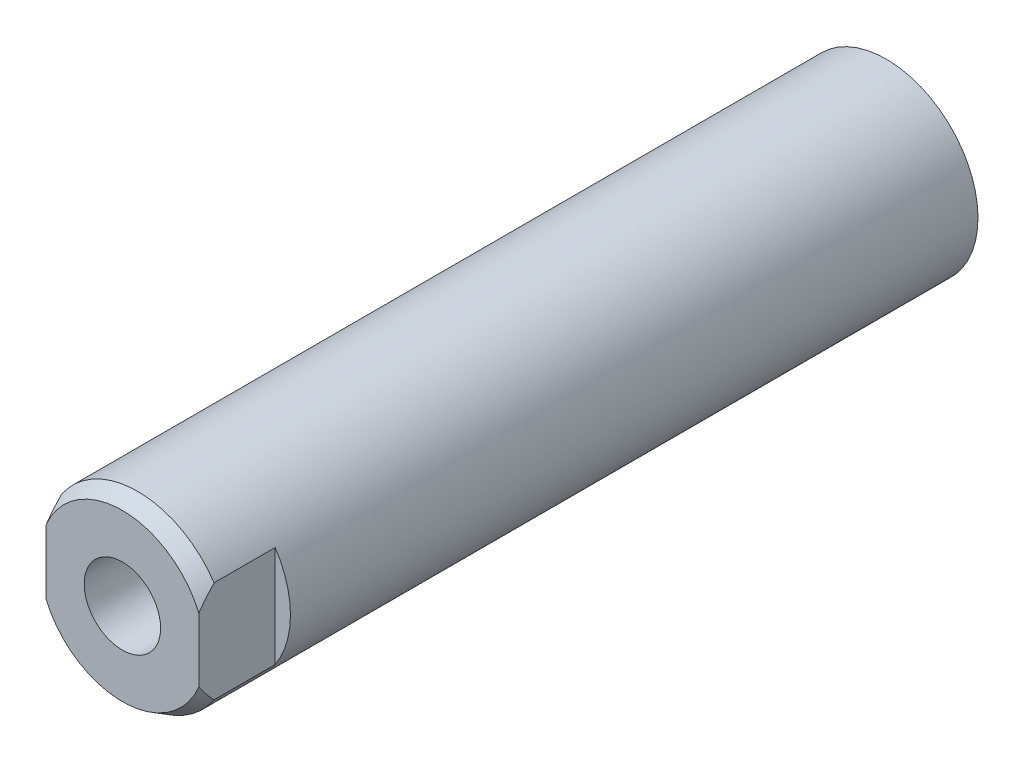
ISO-10303-21;
HEADER;
FILE_DESCRIPTION(('STEP AP214'),'2;1');
FILE_NAME('part.step','',(''),(''),'','','');
FILE_SCHEMA(('AUTOMOTIVE_DESIGN { 1 0 10303 214 1 1 1 1 }'));
ENDSEC;
DATA;
#1=APPLICATION_CONTEXT('core data for automotive mechanical design processes');
#2=APPLICATION_PROTOCOL_DEFINITION('international standard','automotive_design',2000,#1);
#3=PRODUCT_CONTEXT('',#1,'mechanical');
#4=PRODUCT('Part','Part','',(#3));
#5=PRODUCT_RELATED_PRODUCT_CATEGORY('part','',(#4));
#6=PRODUCT_DEFINITION_FORMATION('','',#4);
#7=PRODUCT_DEFINITION_CONTEXT('part definition',#1,'design');
#8=PRODUCT_DEFINITION('design','',#6,#7);
#9=PRODUCT_DEFINITION_SHAPE('','',#8);
#10=(LENGTH_UNIT() NAMED_UNIT(*) SI_UNIT(.MILLI.,.METRE.));
#11=(NAMED_UNIT(*) PLANE_ANGLE_UNIT() SI_UNIT($,.RADIAN.));
#12=(NAMED_UNIT(*) SI_UNIT($,.STERADIAN.) SOLID_ANGLE_UNIT());
#13=UNCERTAINTY_MEASURE_WITH_UNIT(LENGTH_MEASURE(1.E-05),#10,'distance_accuracy_value','');
#14=(GEOMETRIC_REPRESENTATION_CONTEXT(3) GLOBAL_UNCERTAINTY_ASSIGNED_CONTEXT((#13)) GLOBAL_UNIT_ASSIGNED_CONTEXT((#10,
#11,#12)) REPRESENTATION_CONTEXT('',''));
#15=CARTESIAN_POINT('',(0.,0.,0.));
#16=DIRECTION('',(0.,0.,1.));
#17=DIRECTION('',(1.,0.,0.));
#18=AXIS2_PLACEMENT_3D('',#15,#16,#17);
#19=CARTESIAN_POINT('',(0.,0.,-1.));
#20=DIRECTION('',(0.,0.,-1.));
#21=DIRECTION('',(-1.,0.,0.));
#22=AXIS2_PLACEMENT_3D('',#19,#20,#21);
#23=CONICAL_SURFACE('',#22,6.,0.523598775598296);
#24=CARTESIAN_POINT('',(-5.,-8.85766999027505,-8.22515674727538));
#25=CARTESIAN_POINT('',(-5.,-8.7036084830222,-7.99280002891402));
#26=CARTESIAN_POINT('',(-5.,-8.54888837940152,-7.76087738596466));
#27=CARTESIAN_POINT('',(-5.,-8.23787904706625,-7.29807481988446));
#28=CARTESIAN_POINT('',(-5.,-8.08158976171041,-7.06719493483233));
#29=CARTESIAN_POINT('',(-5.,-7.76700623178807,-6.60638363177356));
#30=CARTESIAN_POINT('',(-5.,-7.6087097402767,-6.37645374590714));
#31=CARTESIAN_POINT('',(-5.,-7.2899833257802,-5.91808013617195));
#32=CARTESIAN_POINT('',(-5.,-7.12955342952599,-5.68963639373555));
#33=CARTESIAN_POINT('',(-5.,-6.80168797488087,-5.22825279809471));
#34=CARTESIAN_POINT('',(-5.,-6.63418137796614,-4.99536334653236));
#35=CARTESIAN_POINT('',(-5.,-6.29594329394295,-4.53193915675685));
#36=CARTESIAN_POINT('',(-5.,-6.12521185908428,-4.30140438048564));
#37=CARTESIAN_POINT('',(-5.,-5.77989669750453,-3.84342760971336));
#38=CARTESIAN_POINT('',(-5.,-5.60531511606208,-3.61598400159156));
#39=CARTESIAN_POINT('',(-5.,-5.25127064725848,-3.16493707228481));
#40=CARTESIAN_POINT('',(-5.,-5.07180808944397,-2.94133349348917));
#41=CARTESIAN_POINT('',(-5.,-4.70778635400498,-2.50051757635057));
#42=CARTESIAN_POINT('',(-5.,-4.52326361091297,-2.28327525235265));
#43=CARTESIAN_POINT('',(-5.,-4.1462741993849,-1.85552355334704));
#44=CARTESIAN_POINT('',(-5.,-3.95380358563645,-1.64501761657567));
#45=CARTESIAN_POINT('',(-5.,-3.65800431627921,-1.3373107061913));
#46=CARTESIAN_POINT('',(-5.,-3.55854600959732,-1.23638850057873));
#47=CARTESIAN_POINT('',(-5.,-3.35669407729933,-1.03753063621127));
#48=CARTESIAN_POINT('',(-5.,-3.25430073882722,-0.93959468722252));
#49=CARTESIAN_POINT('',(-5.,-3.04620464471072,-0.74746151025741));
#50=CARTESIAN_POINT('',(-5.,-2.94050460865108,-0.653261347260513));
#51=CARTESIAN_POINT('',(-5.,-2.72521179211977,-0.469439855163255));
#52=CARTESIAN_POINT('',(-5.,-2.61561995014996,-0.37981743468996));
#53=CARTESIAN_POINT('',(-5.,-2.41737252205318,-0.226072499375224));
#54=CARTESIAN_POINT('',(-5.,-2.32962216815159,-0.160785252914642));
#55=CARTESIAN_POINT('',(-5.,-2.15114942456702,-0.034382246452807));
#56=CARTESIAN_POINT('',(-5.,-2.06042702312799,0.0267334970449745));
#57=CARTESIAN_POINT('',(-5.,-1.87562867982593,0.143967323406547));
#58=CARTESIAN_POINT('',(-5.,-1.78154868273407,0.200079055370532));
#59=CARTESIAN_POINT('',(-5.,-1.5899296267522,0.306111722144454));
#60=CARTESIAN_POINT('',(-5.,-1.4923904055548,0.356032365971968));
#61=CARTESIAN_POINT('',(-5.,-1.291974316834,0.449198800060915));
#62=CARTESIAN_POINT('',(-5.,-1.18903262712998,0.492306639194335));
#63=CARTESIAN_POINT('',(-5.,-0.979716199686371,0.569142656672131));
#64=CARTESIAN_POINT('',(-5.,-0.8733430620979,0.602875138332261));
#65=CARTESIAN_POINT('',(-5.,-0.658050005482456,0.65930625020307));
#66=CARTESIAN_POINT('',(-5.,-0.549139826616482,0.682041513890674));
#67=CARTESIAN_POINT('',(-5.,-0.32947006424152,0.715335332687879));
#68=CARTESIAN_POINT('',(-5.,-0.218711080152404,0.725897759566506));
#69=CARTESIAN_POINT('',(-5.,-0.0127563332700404,0.733586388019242));
#70=CARTESIAN_POINT('',(-5.,0.082378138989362,0.732431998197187));
#71=CARTESIAN_POINT('',(-5.,0.272064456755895,0.720793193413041));
#72=CARTESIAN_POINT('',(-5.,0.366616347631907,0.71030951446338));
#73=CARTESIAN_POINT('',(-5.,0.554426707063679,0.680480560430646));
#74=CARTESIAN_POINT('',(-5.,0.647683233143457,0.66112320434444));
#75=CARTESIAN_POINT('',(-5.,0.832164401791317,0.614350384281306));
#76=CARTESIAN_POINT('',(-5.,0.923388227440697,0.586931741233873));
#77=CARTESIAN_POINT('',(-5.,1.13328595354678,0.514715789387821));
#78=CARTESIAN_POINT('',(-5.,1.2510129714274,0.467171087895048));
#79=CARTESIAN_POINT('',(-5.,1.48176506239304,0.361820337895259));
#80=CARTESIAN_POINT('',(-5.,1.59478785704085,0.30400938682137));
#81=CARTESIAN_POINT('',(-5.,1.81655119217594,0.180007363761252));
#82=CARTESIAN_POINT('',(-5.,1.92527749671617,0.113791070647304));
#83=CARTESIAN_POINT('',(-5.,2.13839178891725,-0.0251762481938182));
#84=CARTESIAN_POINT('',(-5.,2.24278078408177,-0.0979257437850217));
#85=CARTESIAN_POINT('',(-5.,2.5038437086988,-0.289931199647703));
#86=CARTESIAN_POINT('',(-5.,2.65783080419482,-0.412830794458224));
#87=CARTESIAN_POINT('',(-5.,2.95823303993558,-0.667617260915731));
#88=CARTESIAN_POINT('',(-5.,3.10464323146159,-0.799509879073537));
#89=CARTESIAN_POINT('',(-5.,3.39152678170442,-1.07019413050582));
#90=CARTESIAN_POINT('',(-5.,3.53198602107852,-1.20900063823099));
#91=CARTESIAN_POINT('',(-5.,3.80771324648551,-1.49158354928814));
#92=CARTESIAN_POINT('',(-5.,3.9429824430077,-1.63535877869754));
#93=CARTESIAN_POINT('',(-5.,4.2103510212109,-1.92797411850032));
#94=CARTESIAN_POINT('',(-5.,4.34241548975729,-2.07684600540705));
#95=CARTESIAN_POINT('',(-5.,4.60294887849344,-2.37770588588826));
#96=CARTESIAN_POINT('',(-5.,4.73141762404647,-2.52969403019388));
#97=CARTESIAN_POINT('',(-5.,4.98516061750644,-2.83596911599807));
#98=CARTESIAN_POINT('',(-5.,5.11043886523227,-2.99025275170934));
#99=CARTESIAN_POINT('',(-5.,5.3584367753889,-3.30086429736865));
#100=CARTESIAN_POINT('',(-5.,5.48115638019,-3.45719225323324));
#101=CARTESIAN_POINT('',(-5.,5.74851674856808,-3.8026963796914));
#102=CARTESIAN_POINT('',(-5.,5.8926806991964,-3.99224116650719));
#103=CARTESIAN_POINT('',(-5.,6.17837278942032,-4.37330562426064));
#104=CARTESIAN_POINT('',(-5.,6.31990089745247,-4.56482531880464));
#105=CARTESIAN_POINT('',(-5.,6.74128772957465,-5.14199066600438));
#106=CARTESIAN_POINT('',(-5.,7.01781542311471,-5.53006826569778));
#107=CARTESIAN_POINT('',(-5.,7.55754763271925,-6.30106249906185));
#108=CARTESIAN_POINT('',(-5.,7.82091246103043,-6.68386751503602));
#109=CARTESIAN_POINT('',(-5.,8.21229240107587,-7.2603583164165));
#110=CARTESIAN_POINT('',(-5.,8.3420955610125,-7.45283346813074));
#111=CARTESIAN_POINT('',(-5.,8.60064308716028,-7.83848938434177));
#112=CARTESIAN_POINT('',(-5.,8.72938746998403,-8.03167013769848));
#113=CARTESIAN_POINT('',(-5.,8.85766999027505,-8.22515674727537));
#114=B_SPLINE_CURVE_WITH_KNOTS('',3,(#24,#25,#26,#27,#28,#29,#30,#31,#32,#33,#34,#35,#36,#37,
#38,#39,#40,#41,#42,#43,#44,#45,#46,#47,#48,#49,#50,#51,#52,#53,#54,#55,#56,#57,#58,#59,#60,#61,
#62,#63,#64,#65,#66,#67,#68,#69,#70,#71,#72,#73,#74,#75,#76,#77,#78,#79,#80,#81,#82,#83,#84,#85,
#86,#87,#88,#89,#90,#91,#92,#93,#94,#95,#96,#97,#98,#99,#100,#101,#102,#103,#104,#105,#106,#107,
#108,#109,#110,#111,#112,#113),.UNSPECIFIED.,.F.,.F.,(4,2,2,2,2,2,2,2,2,2,2,2,2,2,2,2,2,2,2,2,2,
2,2,2,2,2,2,2,2,2,2,2,2,2,2,2,2,2,2,2,2,2,2,2,4),(0.,0.836376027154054,1.67278235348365,
2.51022639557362,3.34765995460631,4.20825562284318,5.06883735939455,5.9289511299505,
6.78900697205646,7.64397449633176,8.49937165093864,8.92440617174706,9.3493992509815,
9.77405153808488,10.1986021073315,10.5266236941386,10.8546465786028,11.1830800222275,
11.5115288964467,11.8459529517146,12.1802232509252,12.5133722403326,12.8464152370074,
13.1313841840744,13.4163306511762,13.7016662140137,13.9871144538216,14.3673767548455,
14.7478211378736,15.1294353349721,15.5109603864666,16.1015030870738,16.6924267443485,
17.2846817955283,17.8767978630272,18.4737500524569,19.0707311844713,19.6669228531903,
20.2631279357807,20.9775178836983,21.6919163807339,23.1213719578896,24.5152832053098,
25.2117426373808,25.9081911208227),.UNSPECIFIED.);
#115=CARTESIAN_POINT('',(-5.,-3.3166247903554,-1.));
#116=VERTEX_POINT('',#115);
#117=CARTESIAN_POINT('',(-5.,-2.09884018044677,0.));
#118=VERTEX_POINT('',#117);
#119=EDGE_CURVE('E44',#116,#118,#114,.T.);
#120=ORIENTED_EDGE('',*,*,#119,.F.);
#121=CARTESIAN_POINT('',(0.,0.,-1.));
#122=DIRECTION('',(0.,0.,1.));
#123=DIRECTION('',(1.,0.,0.));
#124=AXIS2_PLACEMENT_3D('',#121,#122,#123);
#125=CIRCLE('',#124,6.);
#126=CARTESIAN_POINT('',(5.,-3.3166247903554,-1.));
#127=VERTEX_POINT('',#126);
#128=EDGE_CURVE('E126',#127,#116,#125,.F.);
#129=ORIENTED_EDGE('',*,*,#128,.F.);
#130=CARTESIAN_POINT('',(5.,8.85766999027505,-8.22515674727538));
#131=CARTESIAN_POINT('',(5.,8.7036084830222,-7.99280002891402));
#132=CARTESIAN_POINT('',(5.,8.54888837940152,-7.76087738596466));
#133=CARTESIAN_POINT('',(5.,8.23787904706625,-7.29807481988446));
#134=CARTESIAN_POINT('',(5.,8.08158976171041,-7.06719493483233));
#135=CARTESIAN_POINT('',(5.,7.76700623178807,-6.60638363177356));
#136=CARTESIAN_POINT('',(5.,7.6087097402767,-6.37645374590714));
#137=CARTESIAN_POINT('',(5.,7.2899833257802,-5.91808013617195));
#138=CARTESIAN_POINT('',(5.,7.12955342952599,-5.68963639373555));
#139=CARTESIAN_POINT('',(5.,6.80168797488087,-5.22825279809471));
#140=CARTESIAN_POINT('',(5.,6.63418137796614,-4.99536334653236));
#141=CARTESIAN_POINT('',(5.,6.29594329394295,-4.53193915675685));
#142=CARTESIAN_POINT('',(5.,6.12521185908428,-4.30140438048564));
#143=CARTESIAN_POINT('',(5.,5.77989669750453,-3.84342760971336));
#144=CARTESIAN_POINT('',(5.,5.60531511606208,-3.61598400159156));
#145=CARTESIAN_POINT('',(5.,5.25127064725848,-3.16493707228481));
#146=CARTESIAN_POINT('',(5.,5.07180808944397,-2.94133349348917));
#147=CARTESIAN_POINT('',(5.,4.70778635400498,-2.50051757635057));
#148=CARTESIAN_POINT('',(5.,4.52326361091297,-2.28327525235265));
#149=CARTESIAN_POINT('',(5.,4.1462741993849,-1.85552355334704));
#150=CARTESIAN_POINT('',(5.,3.95380358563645,-1.64501761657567));
#151=CARTESIAN_POINT('',(5.,3.65800431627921,-1.3373107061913));
#152=CARTESIAN_POINT('',(5.,3.55854600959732,-1.23638850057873));
#153=CARTESIAN_POINT('',(5.,3.35669407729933,-1.03753063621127));
#154=CARTESIAN_POINT('',(5.,3.25430073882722,-0.93959468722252));
#155=CARTESIAN_POINT('',(5.,3.04620464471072,-0.74746151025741));
#156=CARTESIAN_POINT('',(5.,2.94050460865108,-0.653261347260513));
#157=CARTESIAN_POINT('',(5.,2.72521179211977,-0.469439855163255));
#158=CARTESIAN_POINT('',(5.,2.61561995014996,-0.37981743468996));
#159=CARTESIAN_POINT('',(5.,2.41737252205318,-0.226072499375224));
#160=CARTESIAN_POINT('',(5.,2.32962216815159,-0.160785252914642));
#161=CARTESIAN_POINT('',(5.,2.15114942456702,-0.034382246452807));
#162=CARTESIAN_POINT('',(5.,2.06042702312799,0.0267334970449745));
#163=CARTESIAN_POINT('',(5.,1.87562867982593,0.143967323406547));
#164=CARTESIAN_POINT('',(5.,1.78154868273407,0.200079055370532));
#165=CARTESIAN_POINT('',(5.,1.5899296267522,0.306111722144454));
#166=CARTESIAN_POINT('',(5.,1.4923904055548,0.356032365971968));
#167=CARTESIAN_POINT('',(5.,1.291974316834,0.449198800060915));
#168=CARTESIAN_POINT('',(5.,1.18903262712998,0.492306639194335));
#169=CARTESIAN_POINT('',(5.,0.979716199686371,0.569142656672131));
#170=CARTESIAN_POINT('',(5.,0.8733430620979,0.602875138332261));
#171=CARTESIAN_POINT('',(5.,0.658050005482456,0.65930625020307));
#172=CARTESIAN_POINT('',(5.,0.549139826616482,0.682041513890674));
#173=CARTESIAN_POINT('',(5.,0.32947006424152,0.715335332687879));
#174=CARTESIAN_POINT('',(5.,0.218711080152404,0.725897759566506));
#175=CARTESIAN_POINT('',(5.,0.0127563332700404,0.733586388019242));
#176=CARTESIAN_POINT('',(5.,-0.082378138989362,0.732431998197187));
#177=CARTESIAN_POINT('',(5.,-0.272064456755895,0.720793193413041));
#178=CARTESIAN_POINT('',(5.,-0.366616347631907,0.71030951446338));
#179=CARTESIAN_POINT('',(5.,-0.554426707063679,0.680480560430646));
#180=CARTESIAN_POINT('',(5.,-0.647683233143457,0.66112320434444));
#181=CARTESIAN_POINT('',(5.,-0.832164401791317,0.614350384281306));
#182=CARTESIAN_POINT('',(5.,-0.923388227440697,0.586931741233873));
#183=CARTESIAN_POINT('',(5.,-1.13328595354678,0.514715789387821));
#184=CARTESIAN_POINT('',(5.,-1.2510129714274,0.467171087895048));
#185=CARTESIAN_POINT('',(5.,-1.48176506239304,0.361820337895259));
#186=CARTESIAN_POINT('',(5.,-1.59478785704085,0.30400938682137));
#187=CARTESIAN_POINT('',(5.,-1.81655119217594,0.180007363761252));
#188=CARTESIAN_POINT('',(5.,-1.92527749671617,0.113791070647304));
#189=CARTESIAN_POINT('',(5.,-2.13839178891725,-0.0251762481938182));
#190=CARTESIAN_POINT('',(5.,-2.24278078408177,-0.0979257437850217));
#191=CARTESIAN_POINT('',(5.,-2.5038437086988,-0.289931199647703));
#192=CARTESIAN_POINT('',(5.,-2.65783080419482,-0.412830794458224));
#193=CARTESIAN_POINT('',(5.,-2.95823303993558,-0.667617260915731));
#194=CARTESIAN_POINT('',(5.,-3.10464323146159,-0.799509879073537));
#195=CARTESIAN_POINT('',(5.,-3.39152678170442,-1.07019413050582));
#196=CARTESIAN_POINT('',(5.,-3.53198602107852,-1.20900063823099));
#197=CARTESIAN_POINT('',(5.,-3.80771324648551,-1.49158354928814));
#198=CARTESIAN_POINT('',(5.,-3.9429824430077,-1.63535877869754));
#199=CARTESIAN_POINT('',(5.,-4.2103510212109,-1.92797411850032));
#200=CARTESIAN_POINT('',(5.,-4.34241548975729,-2.07684600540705));
#201=CARTESIAN_POINT('',(5.,-4.60294887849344,-2.37770588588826));
#202=CARTESIAN_POINT('',(5.,-4.73141762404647,-2.52969403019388));
#203=CARTESIAN_POINT('',(5.,-4.98516061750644,-2.83596911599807));
#204=CARTESIAN_POINT('',(5.,-5.11043886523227,-2.99025275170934));
#205=CARTESIAN_POINT('',(5.,-5.3584367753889,-3.30086429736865));
#206=CARTESIAN_POINT('',(5.,-5.48115638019,-3.45719225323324));
#207=CARTESIAN_POINT('',(5.,-5.74851674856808,-3.8026963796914));
#208=CARTESIAN_POINT('',(5.,-5.8926806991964,-3.99224116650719));
#209=CARTESIAN_POINT('',(5.,-6.17837278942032,-4.37330562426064));
#210=CARTESIAN_POINT('',(5.,-6.31990089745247,-4.56482531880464));
#211=CARTESIAN_POINT('',(5.,-6.74128772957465,-5.14199066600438));
#212=CARTESIAN_POINT('',(5.,-7.01781542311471,-5.53006826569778));
#213=CARTESIAN_POINT('',(5.,-7.55754763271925,-6.30106249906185));
#214=CARTESIAN_POINT('',(5.,-7.82091246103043,-6.68386751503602));
#215=CARTESIAN_POINT('',(5.,-8.21229240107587,-7.2603583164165));
#216=CARTESIAN_POINT('',(5.,-8.3420955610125,-7.45283346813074));
#217=CARTESIAN_POINT('',(5.,-8.60064308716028,-7.83848938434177));
#218=CARTESIAN_POINT('',(5.,-8.72938746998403,-8.03167013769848));
#219=CARTESIAN_POINT('',(5.,-8.85766999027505,-8.22515674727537));
#220=B_SPLINE_CURVE_WITH_KNOTS('',3,(#130,#131,#132,#133,#134,#135,#136,#137,#138,#139,#140,
#141,#142,#143,#144,#145,#146,#147,#148,#149,#150,#151,#152,#153,#154,#155,#156,#157,#158,#159,
#160,#161,#162,#163,#164,#165,#166,#167,#168,#169,#170,#171,#172,#173,#174,#175,#176,#177,#178,
#179,#180,#181,#182,#183,#184,#185,#186,#187,#188,#189,#190,#191,#192,#193,#194,#195,#196,#197,
#198,#199,#200,#201,#202,#203,#204,#205,#206,#207,#208,#209,#210,#211,#212,#213,#214,#215,#216,
#217,#218,#219),.UNSPECIFIED.,.F.,.F.,(4,2,2,2,2,2,2,2,2,2,2,2,2,2,2,2,2,2,2,2,2,2,2,2,2,2,2,2,
2,2,2,2,2,2,2,2,2,2,2,2,2,2,2,2,4),(0.,0.836376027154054,1.67278235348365,2.51022639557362,
3.34765995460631,4.20825562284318,5.06883735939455,5.9289511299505,6.78900697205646,
7.64397449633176,8.49937165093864,8.92440617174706,9.3493992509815,9.77405153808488,
10.1986021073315,10.5266236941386,10.8546465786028,11.1830800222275,11.5115288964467,
11.8459529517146,12.1802232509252,12.5133722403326,12.8464152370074,13.1313841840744,
13.4163306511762,13.7016662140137,13.9871144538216,14.3673767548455,14.7478211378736,
15.1294353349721,15.5109603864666,16.1015030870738,16.6924267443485,17.2846817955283,
17.8767978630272,18.4737500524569,19.0707311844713,19.6669228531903,20.2631279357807,
20.9775178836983,21.6919163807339,23.1213719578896,24.5152832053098,25.2117426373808,
25.9081911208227),.UNSPECIFIED.);
#221=CARTESIAN_POINT('',(5.,-2.09884018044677,0.));
#222=VERTEX_POINT('',#221);
#223=EDGE_CURVE('E132',#222,#127,#220,.T.);
#224=ORIENTED_EDGE('',*,*,#223,.F.);
#225=CARTESIAN_POINT('',(0.,0.,0.));
#226=DIRECTION('',(0.,0.,1.));
#227=DIRECTION('',(1.,0.,0.));
#228=AXIS2_PLACEMENT_3D('',#225,#226,#227);
#229=CIRCLE('',#228,5.42264973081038);
#230=EDGE_CURVE('E58',#118,#222,#229,.T.);
#231=ORIENTED_EDGE('',*,*,#230,.F.);
#232=EDGE_LOOP('',(#120,#129,#224,#231));
#233=FACE_BOUND('',#232,.T.);
#234=ADVANCED_FACE('F35',(#233),#23,.T.);
#235=CARTESIAN_POINT('',(0.,0.,0.));
#236=DIRECTION('',(0.,0.,1.));
#237=DIRECTION('',(1.,0.,0.));
#238=AXIS2_PLACEMENT_3D('',#235,#236,#237);
#239=PLANE('',#238);
#240=CARTESIAN_POINT('',(0.,0.,0.));
#241=DIRECTION('',(0.,0.,1.));
#242=DIRECTION('',(1.,0.,0.));
#243=AXIS2_PLACEMENT_3D('',#240,#241,#242);
#244=CIRCLE('',#243,2.5);
#245=CARTESIAN_POINT('',(2.5,0.,0.));
#246=VERTEX_POINT('',#245);
#247=EDGE_CURVE('E99',#246,#246,#244,.T.);
#248=ORIENTED_EDGE('',*,*,#247,.F.);
#249=EDGE_LOOP('',(#248));
#250=FACE_BOUND('',#249,.T.);
#251=CARTESIAN_POINT('',(5.,2.09884018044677,0.));
#252=VERTEX_POINT('',#251);
#253=CARTESIAN_POINT('',(-5.,2.09884018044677,0.));
#254=VERTEX_POINT('',#253);
#255=EDGE_CURVE('E129',#252,#254,#229,.T.);
#256=ORIENTED_EDGE('',*,*,#255,.T.);
#257=DIRECTION('',(0.,1.,0.));
#258=VECTOR('',#257,1.);
#259=CARTESIAN_POINT('',(-5.,-10.5,0.));
#260=LINE('',#259,#258);
#261=EDGE_CURVE('E51',#118,#254,#260,.T.);
#262=ORIENTED_EDGE('',*,*,#261,.F.);
#263=ORIENTED_EDGE('',*,*,#230,.T.);
#264=DIRECTION('',(0.,1.,0.));
#265=VECTOR('',#264,1.);
#266=CARTESIAN_POINT('',(5.,-10.5,0.));
#267=LINE('',#266,#265);
#268=EDGE_CURVE('E112',#222,#252,#267,.T.);
#269=ORIENTED_EDGE('',*,*,#268,.T.);
#270=EDGE_LOOP('',(#256,#262,#263,#269));
#271=FACE_BOUND('',#270,.T.);
#272=ADVANCED_FACE('F148',(#250,#271),#239,.T.);
#273=CARTESIAN_POINT('',(0.,0.,-50.));
#274=DIRECTION('',(0.,0.,1.));
#275=DIRECTION('',(1.,0.,0.));
#276=AXIS2_PLACEMENT_3D('',#273,#274,#275);
#277=PLANE('',#276);
#278=CARTESIAN_POINT('',(0.,0.,-50.));
#279=DIRECTION('',(0.,0.,1.));
#280=DIRECTION('',(1.,0.,0.));
#281=AXIS2_PLACEMENT_3D('',#278,#279,#280);
#282=CIRCLE('',#281,6.);
#283=CARTESIAN_POINT('',(6.,0.,-50.));
#284=VERTEX_POINT('',#283);
#285=EDGE_CURVE('E122',#284,#284,#282,.T.);
#286=ORIENTED_EDGE('',*,*,#285,.F.);
#287=EDGE_LOOP('',(#286));
#288=FACE_BOUND('',#287,.T.);
#289=ADVANCED_FACE('F151',(#288),#277,.F.);
#290=CARTESIAN_POINT('',(0.,0.,-50.));
#291=DIRECTION('',(0.,0.,1.));
#292=DIRECTION('',(1.,0.,0.));
#293=AXIS2_PLACEMENT_3D('',#290,#291,#292);
#294=CYLINDRICAL_SURFACE('',#293,6.);
#295=DIRECTION('',(0.,0.,1.));
#296=VECTOR('',#295,1.);
#297=CARTESIAN_POINT('',(-5.,3.3166247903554,-50.));
#298=LINE('',#297,#296);
#299=CARTESIAN_POINT('',(-5.,3.3166247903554,-1.));
#300=VERTEX_POINT('',#299);
#301=CARTESIAN_POINT('',(-5.,3.3166247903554,-5.));
#302=VERTEX_POINT('',#301);
#303=EDGE_CURVE('E107',#300,#302,#298,.F.);
#304=ORIENTED_EDGE('',*,*,#303,.F.);
#305=CARTESIAN_POINT('',(5.,3.3166247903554,-1.));
#306=VERTEX_POINT('',#305);
#307=EDGE_CURVE('E125',#300,#306,#125,.F.);
#308=ORIENTED_EDGE('',*,*,#307,.T.);
#309=DIRECTION('',(0.,0.,1.));
#310=VECTOR('',#309,1.);
#311=CARTESIAN_POINT('',(5.,3.3166247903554,-50.));
#312=LINE('',#311,#310);
#313=CARTESIAN_POINT('',(5.,3.3166247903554,-5.));
#314=VERTEX_POINT('',#313);
#315=EDGE_CURVE('E119',#314,#306,#312,.T.);
#316=ORIENTED_EDGE('',*,*,#315,.F.);
#317=CARTESIAN_POINT('',(0.,0.,-5.));
#318=DIRECTION('',(0.,0.,-1.));
#319=DIRECTION('',(-1.,0.,0.));
#320=AXIS2_PLACEMENT_3D('',#317,#318,#319);
#321=CIRCLE('',#320,6.);
#322=CARTESIAN_POINT('',(5.,-3.3166247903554,-5.));
#323=VERTEX_POINT('',#322);
#324=EDGE_CURVE('E139',#323,#314,#321,.F.);
#325=ORIENTED_EDGE('',*,*,#324,.F.);
#326=DIRECTION('',(0.,0.,1.));
#327=VECTOR('',#326,1.);
#328=CARTESIAN_POINT('',(5.,-3.3166247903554,-50.));
#329=LINE('',#328,#327);
#330=EDGE_CURVE('E116',#127,#323,#329,.F.);
#331=ORIENTED_EDGE('',*,*,#330,.F.);
#332=ORIENTED_EDGE('',*,*,#128,.T.);
#333=DIRECTION('',(0.,0.,1.));
#334=VECTOR('',#333,1.);
#335=CARTESIAN_POINT('',(-5.,-3.3166247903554,-50.));
#336=LINE('',#335,#334);
#337=CARTESIAN_POINT('',(-5.,-3.3166247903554,-5.));
#338=VERTEX_POINT('',#337);
#339=EDGE_CURVE('E110',#338,#116,#336,.T.);
#340=ORIENTED_EDGE('',*,*,#339,.F.);
#341=CARTESIAN_POINT('',(0.,0.,-5.));
#342=DIRECTION('',(0.,0.,-1.));
#343=DIRECTION('',(-1.,0.,0.));
#344=AXIS2_PLACEMENT_3D('',#341,#342,#343);
#345=CIRCLE('',#344,6.);
#346=EDGE_CURVE('E11',#302,#338,#345,.F.);
#347=ORIENTED_EDGE('',*,*,#346,.F.);
#348=EDGE_LOOP('',(#304,#308,#316,#325,#331,#332,#340,#347));
#349=FACE_BOUND('',#348,.T.);
#350=ORIENTED_EDGE('',*,*,#285,.T.);
#351=EDGE_LOOP('',(#350));
#352=FACE_BOUND('',#351,.T.);
#353=ADVANCED_FACE('F154',(#349,#352),#294,.T.);
#354=EDGE_CURVE('E171',#254,#300,#114,.T.);
#355=ORIENTED_EDGE('',*,*,#354,.F.);
#356=ORIENTED_EDGE('',*,*,#255,.F.);
#357=EDGE_CURVE('E138',#306,#252,#220,.T.);
#358=ORIENTED_EDGE('',*,*,#357,.F.);
#359=ORIENTED_EDGE('',*,*,#307,.F.);
#360=EDGE_LOOP('',(#355,#356,#358,#359));
#361=FACE_BOUND('',#360,.T.);
#362=ADVANCED_FACE('F37',(#361),#23,.T.);
#363=CARTESIAN_POINT('',(5.,-10.5,0.));
#364=DIRECTION('',(-1.,0.,0.));
#365=DIRECTION('',(0.,0.,1.));
#366=AXIS2_PLACEMENT_3D('',#363,#364,#365);
#367=PLANE('',#366);
#368=ORIENTED_EDGE('',*,*,#315,.T.);
#369=ORIENTED_EDGE('',*,*,#357,.T.);
#370=ORIENTED_EDGE('',*,*,#268,.F.);
#371=ORIENTED_EDGE('',*,*,#223,.T.);
#372=ORIENTED_EDGE('',*,*,#330,.T.);
#373=DIRECTION('',(0.,1.,0.));
#374=VECTOR('',#373,1.);
#375=CARTESIAN_POINT('',(5.,-10.5,-5.));
#376=LINE('',#375,#374);
#377=EDGE_CURVE('E113',#323,#314,#376,.T.);
#378=ORIENTED_EDGE('',*,*,#377,.T.);
#379=EDGE_LOOP('',(#368,#369,#370,#371,#372,#378));
#380=FACE_BOUND('',#379,.T.);
#381=ADVANCED_FACE('F140',(#380),#367,.F.);
#382=CARTESIAN_POINT('',(5.,-10.5,-5.));
#383=DIRECTION('',(0.,0.,-1.));
#384=DIRECTION('',(-1.,0.,0.));
#385=AXIS2_PLACEMENT_3D('',#382,#383,#384);
#386=PLANE('',#385);
#387=ORIENTED_EDGE('',*,*,#324,.T.);
#388=ORIENTED_EDGE('',*,*,#377,.F.);
#389=EDGE_LOOP('',(#387,#388));
#390=FACE_BOUND('',#389,.T.);
#391=ADVANCED_FACE('F145',(#390),#386,.F.);
#392=CARTESIAN_POINT('',(-7.60413712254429,-10.5,-5.));
#393=DIRECTION('',(0.,0.,-1.));
#394=DIRECTION('',(-1.,0.,0.));
#395=AXIS2_PLACEMENT_3D('',#392,#393,#394);
#396=PLANE('',#395);
#397=ORIENTED_EDGE('',*,*,#346,.T.);
#398=DIRECTION('',(0.,1.,0.));
#399=VECTOR('',#398,1.);
#400=CARTESIAN_POINT('',(-5.,-10.5,-5.));
#401=LINE('',#400,#399);
#402=EDGE_CURVE('E101',#338,#302,#401,.T.);
#403=ORIENTED_EDGE('',*,*,#402,.T.);
#404=EDGE_LOOP('',(#397,#403));
#405=FACE_BOUND('',#404,.T.);
#406=ADVANCED_FACE('F185',(#405),#396,.F.);
#407=CARTESIAN_POINT('',(-5.,-10.5,0.));
#408=DIRECTION('',(1.,0.,0.));
#409=DIRECTION('',(0.,0.,-1.));
#410=AXIS2_PLACEMENT_3D('',#407,#408,#409);
#411=PLANE('',#410);
#412=ORIENTED_EDGE('',*,*,#339,.T.);
#413=ORIENTED_EDGE('',*,*,#119,.T.);
#414=ORIENTED_EDGE('',*,*,#261,.T.);
#415=ORIENTED_EDGE('',*,*,#354,.T.);
#416=ORIENTED_EDGE('',*,*,#303,.T.);
#417=ORIENTED_EDGE('',*,*,#402,.F.);
#418=EDGE_LOOP('',(#412,#413,#414,#415,#416,#417));
#419=FACE_BOUND('',#418,.T.);
#420=ADVANCED_FACE('F93',(#419),#411,.F.);
#421=CARTESIAN_POINT('',(0.,0.,-21.));
#422=DIRECTION('',(0.,0.,1.));
#423=DIRECTION('',(1.,0.,0.));
#424=AXIS2_PLACEMENT_3D('',#421,#422,#423);
#425=CONICAL_SURFACE('',#424,2.5,1.02974425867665);
#426=CARTESIAN_POINT('',(0.,0.,-22.5021515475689));
#427=VERTEX_POINT('',#426);
#428=VERTEX_LOOP('',#427);
#429=FACE_BOUND('',#428,.T.);
#430=CARTESIAN_POINT('',(0.,0.,-21.));
#431=DIRECTION('',(0.,0.,1.));
#432=DIRECTION('',(1.,0.,0.));
#433=AXIS2_PLACEMENT_3D('',#430,#431,#432);
#434=CIRCLE('',#433,2.5);
#435=CARTESIAN_POINT('',(2.5,0.,-21.));
#436=VERTEX_POINT('',#435);
#437=EDGE_CURVE('E97',#436,#436,#434,.T.);
#438=ORIENTED_EDGE('',*,*,#437,.T.);
#439=EDGE_LOOP('',(#438));
#440=FACE_BOUND('',#439,.T.);
#441=ADVANCED_FACE('F89',(#429,#440),#425,.F.);
#442=CARTESIAN_POINT('',(0.,0.,0.));
#443=DIRECTION('',(0.,0.,1.));
#444=DIRECTION('',(1.,0.,0.));
#445=AXIS2_PLACEMENT_3D('',#442,#443,#444);
#446=CYLINDRICAL_SURFACE('',#445,2.5);
#447=ORIENTED_EDGE('',*,*,#437,.F.);
#448=EDGE_LOOP('',(#447));
#449=FACE_BOUND('',#448,.T.);
#450=ORIENTED_EDGE('',*,*,#247,.T.);
#451=EDGE_LOOP('',(#450));
#452=FACE_BOUND('',#451,.T.);
#453=ADVANCED_FACE('F92',(#449,#452),#446,.F.);
#454=CLOSED_SHELL('',(#234,#272,#289,#353,#362,#381,#391,#406,#420,#441,#453));
#455=MANIFOLD_SOLID_BREP('B2',#454);
#456=ADVANCED_BREP_SHAPE_REPRESENTATION('',(#18,#455),#14);
#457=SHAPE_DEFINITION_REPRESENTATION(#9,#456);
ENDSEC;
END-ISO-10303-21;
